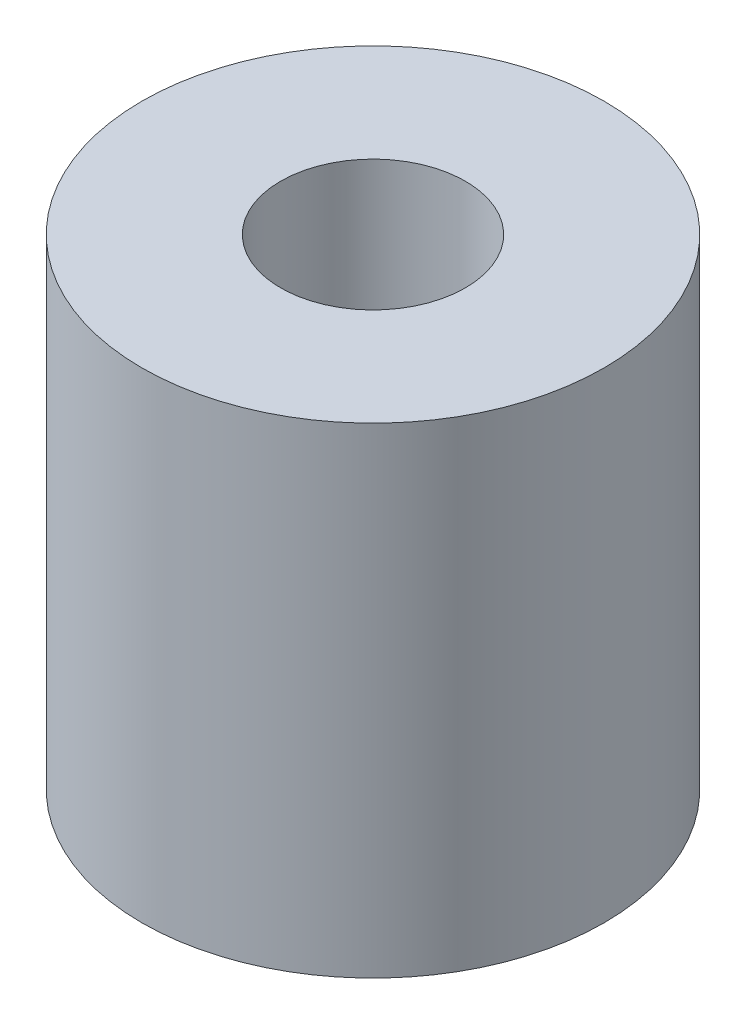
ISO-10303-21;
HEADER;
FILE_DESCRIPTION(('STEP AP214'),'2;1');
FILE_NAME('part.step','',(''),(''),'','','');
FILE_SCHEMA(('AUTOMOTIVE_DESIGN { 1 0 10303 214 1 1 1 1 }'));
ENDSEC;
DATA;
#1=APPLICATION_CONTEXT('core data for automotive mechanical design processes');
#2=APPLICATION_PROTOCOL_DEFINITION('international standard','automotive_design',2000,#1);
#3=PRODUCT_CONTEXT('',#1,'mechanical');
#4=PRODUCT('Part','Part','',(#3));
#5=PRODUCT_RELATED_PRODUCT_CATEGORY('part','',(#4));
#6=PRODUCT_DEFINITION_FORMATION('','',#4);
#7=PRODUCT_DEFINITION_CONTEXT('part definition',#1,'design');
#8=PRODUCT_DEFINITION('design','',#6,#7);
#9=PRODUCT_DEFINITION_SHAPE('','',#8);
#10=(LENGTH_UNIT() NAMED_UNIT(*) SI_UNIT(.MILLI.,.METRE.));
#11=(NAMED_UNIT(*) PLANE_ANGLE_UNIT() SI_UNIT($,.RADIAN.));
#12=(NAMED_UNIT(*) SI_UNIT($,.STERADIAN.) SOLID_ANGLE_UNIT());
#13=UNCERTAINTY_MEASURE_WITH_UNIT(LENGTH_MEASURE(1.E-05),#10,'distance_accuracy_value','');
#14=(GEOMETRIC_REPRESENTATION_CONTEXT(3) GLOBAL_UNCERTAINTY_ASSIGNED_CONTEXT((#13)) GLOBAL_UNIT_ASSIGNED_CONTEXT((#10,
#11,#12)) REPRESENTATION_CONTEXT('',''));
#15=CARTESIAN_POINT('',(0.,0.,0.));
#16=DIRECTION('',(0.,0.,1.));
#17=DIRECTION('',(1.,0.,0.));
#18=AXIS2_PLACEMENT_3D('',#15,#16,#17);
#19=CARTESIAN_POINT('',(0.,5.2,0.));
#20=DIRECTION('',(0.,1.,0.));
#21=DIRECTION('',(-1.,0.,0.));
#22=AXIS2_PLACEMENT_3D('',#19,#20,#21);
#23=CYLINDRICAL_SURFACE('',#22,0.999999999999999);
#24=CARTESIAN_POINT('',(0.,5.2,0.));
#25=DIRECTION('',(0.,1.,0.));
#26=DIRECTION('',(-1.,0.,0.));
#27=AXIS2_PLACEMENT_3D('',#24,#25,#26);
#28=CIRCLE('',#27,0.999999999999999);
#29=CARTESIAN_POINT('',(-0.999999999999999,5.2,0.));
#30=VERTEX_POINT('',#29);
#31=EDGE_CURVE('E43',#30,#30,#28,.T.);
#32=ORIENTED_EDGE('',*,*,#31,.F.);
#33=EDGE_LOOP('',(#32));
#34=FACE_BOUND('',#33,.T.);
#35=CARTESIAN_POINT('',(0.,7.2,0.));
#36=DIRECTION('',(0.,1.,0.));
#37=DIRECTION('',(-1.,0.,0.));
#38=AXIS2_PLACEMENT_3D('',#35,#36,#37);
#39=CIRCLE('',#38,1.);
#40=CARTESIAN_POINT('',(-1.,7.2,0.));
#41=VERTEX_POINT('',#40);
#42=EDGE_CURVE('E10',#41,#41,#39,.T.);
#43=ORIENTED_EDGE('',*,*,#42,.T.);
#44=EDGE_LOOP('',(#43));
#45=FACE_BOUND('',#44,.T.);
#46=ADVANCED_FACE('F29',(#34,#45),#23,.F.);
#47=CARTESIAN_POINT('',(0.999999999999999,7.2,0.));
#48=DIRECTION('',(0.,-1.,0.));
#49=DIRECTION('',(1.,0.,0.));
#50=AXIS2_PLACEMENT_3D('',#47,#48,#49);
#51=PLANE('',#50);
#52=ORIENTED_EDGE('',*,*,#42,.F.);
#53=EDGE_LOOP('',(#52));
#54=FACE_BOUND('',#53,.T.);
#55=CARTESIAN_POINT('',(0.,7.2,0.));
#56=DIRECTION('',(0.,1.,0.));
#57=DIRECTION('',(-1.,0.,0.));
#58=AXIS2_PLACEMENT_3D('',#55,#56,#57);
#59=CIRCLE('',#58,2.5);
#60=CARTESIAN_POINT('',(-2.5,7.2,0.));
#61=VERTEX_POINT('',#60);
#62=EDGE_CURVE('E35',#61,#61,#59,.T.);
#63=ORIENTED_EDGE('',*,*,#62,.T.);
#64=EDGE_LOOP('',(#63));
#65=FACE_BOUND('',#64,.T.);
#66=ADVANCED_FACE('F52',(#54,#65),#51,.F.);
#67=CARTESIAN_POINT('',(0.,5.2,0.));
#68=DIRECTION('',(0.,1.,0.));
#69=DIRECTION('',(-1.,0.,0.));
#70=AXIS2_PLACEMENT_3D('',#67,#68,#69);
#71=CYLINDRICAL_SURFACE('',#70,2.5);
#72=ORIENTED_EDGE('',*,*,#62,.F.);
#73=EDGE_LOOP('',(#72));
#74=FACE_BOUND('',#73,.T.);
#75=CARTESIAN_POINT('',(0.,2.,0.));
#76=DIRECTION('',(0.,1.,0.));
#77=DIRECTION('',(-1.,0.,0.));
#78=AXIS2_PLACEMENT_3D('',#75,#76,#77);
#79=CIRCLE('',#78,2.5);
#80=CARTESIAN_POINT('',(-2.5,2.,0.));
#81=VERTEX_POINT('',#80);
#82=EDGE_CURVE('E39',#81,#81,#79,.T.);
#83=ORIENTED_EDGE('',*,*,#82,.T.);
#84=EDGE_LOOP('',(#83));
#85=FACE_BOUND('',#84,.T.);
#86=ADVANCED_FACE('F56',(#74,#85),#71,.T.);
#87=CARTESIAN_POINT('',(2.5,2.,0.));
#88=DIRECTION('',(0.,1.,0.));
#89=DIRECTION('',(-1.,0.,0.));
#90=AXIS2_PLACEMENT_3D('',#87,#88,#89);
#91=PLANE('',#90);
#92=ORIENTED_EDGE('',*,*,#82,.F.);
#93=EDGE_LOOP('',(#92));
#94=FACE_BOUND('',#93,.T.);
#95=ADVANCED_FACE('F61',(#94),#91,.F.);
#96=CARTESIAN_POINT('',(0.,5.2,0.));
#97=DIRECTION('',(0.,-1.,0.));
#98=DIRECTION('',(1.,0.,0.));
#99=AXIS2_PLACEMENT_3D('',#96,#97,#98);
#100=PLANE('',#99);
#101=ORIENTED_EDGE('',*,*,#31,.T.);
#102=EDGE_LOOP('',(#101));
#103=FACE_BOUND('',#102,.T.);
#104=ADVANCED_FACE('F49',(#103),#100,.F.);
#105=CLOSED_SHELL('',(#46,#66,#86,#95,#104));
#106=MANIFOLD_SOLID_BREP('B2',#105);
#107=ADVANCED_BREP_SHAPE_REPRESENTATION('',(#18,#106),#14);
#108=SHAPE_DEFINITION_REPRESENTATION(#9,#107);
ENDSEC;
END-ISO-10303-21;
